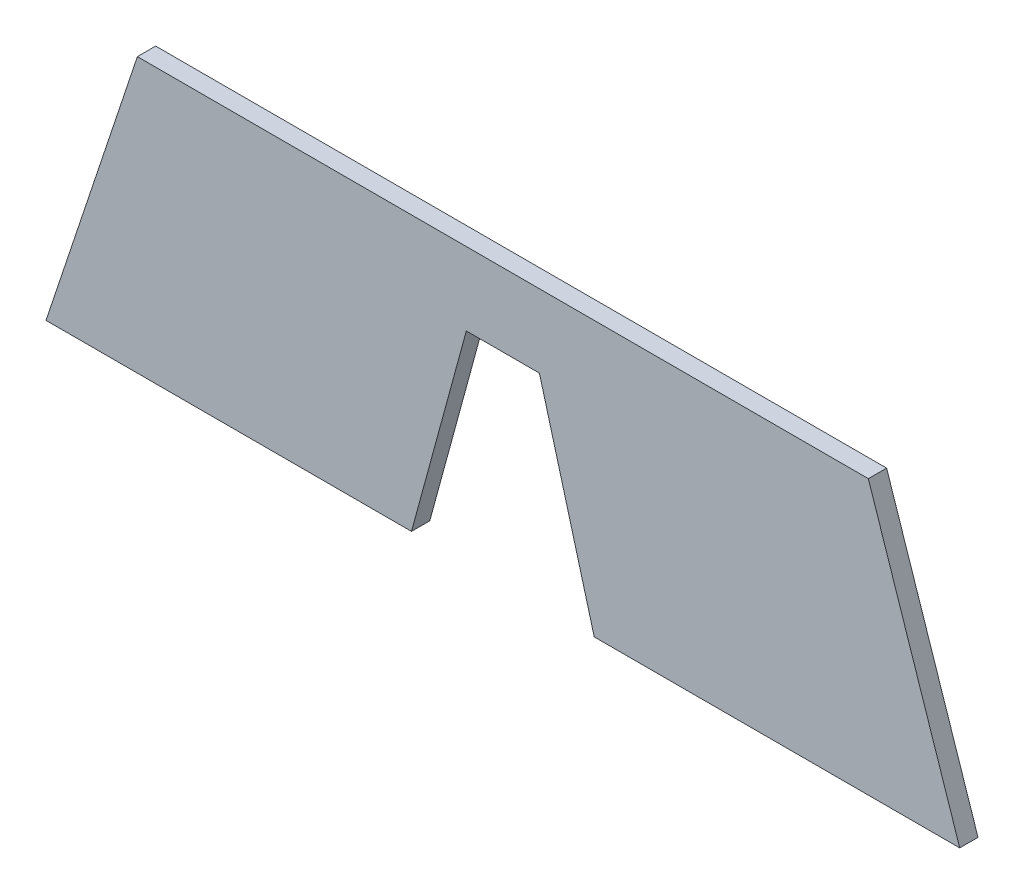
ISO-10303-21;
HEADER;
FILE_DESCRIPTION(('STEP AP214'),'2;1');
FILE_NAME('part.step','',(''),(''),'','','');
FILE_SCHEMA(('AUTOMOTIVE_DESIGN { 1 0 10303 214 1 1 1 1 }'));
ENDSEC;
DATA;
#1=APPLICATION_CONTEXT('core data for automotive mechanical design processes');
#2=APPLICATION_PROTOCOL_DEFINITION('international standard','automotive_design',2000,#1);
#3=PRODUCT_CONTEXT('',#1,'mechanical');
#4=PRODUCT('Part','Part','',(#3));
#5=PRODUCT_RELATED_PRODUCT_CATEGORY('part','',(#4));
#6=PRODUCT_DEFINITION_FORMATION('','',#4);
#7=PRODUCT_DEFINITION_CONTEXT('part definition',#1,'design');
#8=PRODUCT_DEFINITION('design','',#6,#7);
#9=PRODUCT_DEFINITION_SHAPE('','',#8);
#10=(LENGTH_UNIT() NAMED_UNIT(*) SI_UNIT(.MILLI.,.METRE.));
#11=(NAMED_UNIT(*) PLANE_ANGLE_UNIT() SI_UNIT($,.RADIAN.));
#12=(NAMED_UNIT(*) SI_UNIT($,.STERADIAN.) SOLID_ANGLE_UNIT());
#13=UNCERTAINTY_MEASURE_WITH_UNIT(LENGTH_MEASURE(1.E-05),#10,'distance_accuracy_value','');
#14=(GEOMETRIC_REPRESENTATION_CONTEXT(3) GLOBAL_UNCERTAINTY_ASSIGNED_CONTEXT((#13)) GLOBAL_UNIT_ASSIGNED_CONTEXT((#10,
#11,#12)) REPRESENTATION_CONTEXT('',''));
#15=CARTESIAN_POINT('',(0.,0.,0.));
#16=DIRECTION('',(0.,0.,1.));
#17=DIRECTION('',(1.,0.,0.));
#18=AXIS2_PLACEMENT_3D('',#15,#16,#17);
#19=CARTESIAN_POINT('',(0.,-8.00000000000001,2.));
#20=DIRECTION('',(0.,1.,0.));
#21=DIRECTION('',(-1.,0.,0.));
#22=AXIS2_PLACEMENT_3D('',#19,#20,#21);
#23=PLANE('',#22);
#24=DIRECTION('',(1.,0.,0.));
#25=VECTOR('',#24,1.);
#26=CARTESIAN_POINT('',(0.,-8.00000000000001,0.));
#27=LINE('',#26,#25);
#28=CARTESIAN_POINT('',(7.12802538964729,-8.,0.));
#29=VERTEX_POINT('',#28);
#30=CARTESIAN_POINT('',(15.1280253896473,-7.99999999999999,0.));
#31=VERTEX_POINT('',#30);
#32=EDGE_CURVE('E191',#29,#31,#27,.T.);
#33=ORIENTED_EDGE('',*,*,#32,.T.);
#34=DIRECTION('',(0.,0.,-1.));
#35=VECTOR('',#34,1.);
#36=CARTESIAN_POINT('',(15.1280253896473,-7.99999999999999,2.));
#37=LINE('',#36,#35);
#38=CARTESIAN_POINT('',(15.1280253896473,-7.99999999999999,2.));
#39=VERTEX_POINT('',#38);
#40=EDGE_CURVE('E11',#39,#31,#37,.T.);
#41=ORIENTED_EDGE('',*,*,#40,.F.);
#42=DIRECTION('',(1.,0.,0.));
#43=VECTOR('',#42,1.);
#44=CARTESIAN_POINT('',(0.,-8.00000000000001,2.));
#45=LINE('',#44,#43);
#46=CARTESIAN_POINT('',(7.12802538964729,-8.,2.));
#47=VERTEX_POINT('',#46);
#48=EDGE_CURVE('E148',#47,#39,#45,.T.);
#49=ORIENTED_EDGE('',*,*,#48,.F.);
#50=DIRECTION('',(0.,0.,-1.));
#51=VECTOR('',#50,1.);
#52=CARTESIAN_POINT('',(7.12802538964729,-8.,2.));
#53=LINE('',#52,#51);
#54=EDGE_CURVE('E138',#47,#29,#53,.T.);
#55=ORIENTED_EDGE('',*,*,#54,.T.);
#56=EDGE_LOOP('',(#33,#41,#49,#55));
#57=FACE_BOUND('',#56,.T.);
#58=ADVANCED_FACE('F41',(#57),#23,.F.);
#59=CARTESIAN_POINT('',(12.0499313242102,3.28634490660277,2.));
#60=DIRECTION('',(0.964763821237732,0.263117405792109,0.));
#61=DIRECTION('',(-0.263117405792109,0.964763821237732,0.));
#62=AXIS2_PLACEMENT_3D('',#59,#60,#61);
#63=PLANE('',#62);
#64=DIRECTION('',(0.263117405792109,-0.964763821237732,0.));
#65=VECTOR('',#64,1.);
#66=CARTESIAN_POINT('',(12.0499313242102,3.28634490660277,0.));
#67=LINE('',#66,#65);
#68=CARTESIAN_POINT('',(21.1280253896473,-30.,0.));
#69=VERTEX_POINT('',#68);
#70=EDGE_CURVE('E182',#31,#69,#67,.T.);
#71=ORIENTED_EDGE('',*,*,#70,.T.);
#72=DIRECTION('',(0.,0.,-1.));
#73=VECTOR('',#72,1.);
#74=CARTESIAN_POINT('',(21.1280253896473,-30.,2.));
#75=LINE('',#74,#73);
#76=CARTESIAN_POINT('',(21.1280253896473,-30.,2.));
#77=VERTEX_POINT('',#76);
#78=EDGE_CURVE('E50',#77,#69,#75,.T.);
#79=ORIENTED_EDGE('',*,*,#78,.F.);
#80=DIRECTION('',(0.263117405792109,-0.964763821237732,0.));
#81=VECTOR('',#80,1.);
#82=CARTESIAN_POINT('',(12.0499313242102,3.28634490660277,2.));
#83=LINE('',#82,#81);
#84=EDGE_CURVE('E101',#39,#77,#83,.T.);
#85=ORIENTED_EDGE('',*,*,#84,.F.);
#86=ORIENTED_EDGE('',*,*,#40,.T.);
#87=EDGE_LOOP('',(#71,#79,#85,#86));
#88=FACE_BOUND('',#87,.T.);
#89=ADVANCED_FACE('F210',(#88),#63,.F.);
#90=CARTESIAN_POINT('',(0.,-30.,2.));
#91=DIRECTION('',(0.,1.,0.));
#92=DIRECTION('',(0.,0.,1.));
#93=AXIS2_PLACEMENT_3D('',#90,#91,#92);
#94=PLANE('',#93);
#95=DIRECTION('',(1.,0.,0.));
#96=VECTOR('',#95,1.);
#97=CARTESIAN_POINT('',(0.,-30.,0.));
#98=LINE('',#97,#96);
#99=CARTESIAN_POINT('',(61.1280253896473,-30.,0.));
#100=VERTEX_POINT('',#99);
#101=EDGE_CURVE('E157',#69,#100,#98,.T.);
#102=ORIENTED_EDGE('',*,*,#101,.T.);
#103=DIRECTION('',(0.,0.,-1.));
#104=VECTOR('',#103,1.);
#105=CARTESIAN_POINT('',(61.1280253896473,-30.,2.));
#106=LINE('',#105,#104);
#107=CARTESIAN_POINT('',(61.1280253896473,-30.,2.));
#108=VERTEX_POINT('',#107);
#109=EDGE_CURVE('E170',#108,#100,#106,.T.);
#110=ORIENTED_EDGE('',*,*,#109,.F.);
#111=DIRECTION('',(1.,0.,0.));
#112=VECTOR('',#111,1.);
#113=CARTESIAN_POINT('',(0.,-30.,2.));
#114=LINE('',#113,#112);
#115=EDGE_CURVE('E136',#77,#108,#114,.T.);
#116=ORIENTED_EDGE('',*,*,#115,.F.);
#117=ORIENTED_EDGE('',*,*,#78,.T.);
#118=EDGE_LOOP('',(#102,#110,#116,#117));
#119=FACE_BOUND('',#118,.T.);
#120=ADVANCED_FACE('F177',(#119),#94,.F.);
#121=CARTESIAN_POINT('',(46.0152228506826,15.3384076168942,2.));
#122=DIRECTION('',(-0.948683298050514,-0.316227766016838,0.));
#123=DIRECTION('',(0.316227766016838,-0.948683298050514,0.));
#124=AXIS2_PLACEMENT_3D('',#121,#122,#123);
#125=PLANE('',#124);
#126=DIRECTION('',(-0.316227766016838,0.948683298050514,0.));
#127=VECTOR('',#126,1.);
#128=CARTESIAN_POINT('',(46.0152228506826,15.3384076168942,0.));
#129=LINE('',#128,#127);
#130=CARTESIAN_POINT('',(51.1280253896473,0.,0.));
#131=VERTEX_POINT('',#130);
#132=EDGE_CURVE('E185',#100,#131,#129,.T.);
#133=ORIENTED_EDGE('',*,*,#132,.T.);
#134=DIRECTION('',(0.,0.,-1.));
#135=VECTOR('',#134,1.);
#136=CARTESIAN_POINT('',(51.1280253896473,0.,2.));
#137=LINE('',#136,#135);
#138=CARTESIAN_POINT('',(51.1280253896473,0.,2.));
#139=VERTEX_POINT('',#138);
#140=EDGE_CURVE('E167',#139,#131,#137,.T.);
#141=ORIENTED_EDGE('',*,*,#140,.F.);
#142=DIRECTION('',(-0.316227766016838,0.948683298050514,0.));
#143=VECTOR('',#142,1.);
#144=CARTESIAN_POINT('',(46.0152228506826,15.3384076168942,2.));
#145=LINE('',#144,#143);
#146=EDGE_CURVE('E143',#108,#139,#145,.T.);
#147=ORIENTED_EDGE('',*,*,#146,.F.);
#148=ORIENTED_EDGE('',*,*,#109,.T.);
#149=EDGE_LOOP('',(#133,#141,#147,#148));
#150=FACE_BOUND('',#149,.T.);
#151=ADVANCED_FACE('F202',(#150),#125,.F.);
#152=CARTESIAN_POINT('',(0.,0.,2.));
#153=DIRECTION('',(0.,1.,0.));
#154=DIRECTION('',(0.,0.,1.));
#155=AXIS2_PLACEMENT_3D('',#152,#153,#154);
#156=PLANE('',#155);
#157=DIRECTION('',(1.,0.,0.));
#158=VECTOR('',#157,1.);
#159=CARTESIAN_POINT('',(0.,0.,0.));
#160=LINE('',#159,#158);
#161=CARTESIAN_POINT('',(-28.8719746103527,0.,0.));
#162=VERTEX_POINT('',#161);
#163=EDGE_CURVE('E189',#162,#131,#160,.T.);
#164=ORIENTED_EDGE('',*,*,#163,.F.);
#165=DIRECTION('',(0.,0.,-1.));
#166=VECTOR('',#165,1.);
#167=CARTESIAN_POINT('',(-28.8719746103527,0.,2.));
#168=LINE('',#167,#166);
#169=CARTESIAN_POINT('',(-28.8719746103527,0.,2.));
#170=VERTEX_POINT('',#169);
#171=EDGE_CURVE('E130',#170,#162,#168,.T.);
#172=ORIENTED_EDGE('',*,*,#171,.F.);
#173=DIRECTION('',(1.,0.,0.));
#174=VECTOR('',#173,1.);
#175=CARTESIAN_POINT('',(0.,0.,2.));
#176=LINE('',#175,#174);
#177=EDGE_CURVE('E121',#170,#139,#176,.T.);
#178=ORIENTED_EDGE('',*,*,#177,.T.);
#179=ORIENTED_EDGE('',*,*,#140,.T.);
#180=EDGE_LOOP('',(#164,#172,#178,#179));
#181=FACE_BOUND('',#180,.T.);
#182=ADVANCED_FACE('F198',(#181),#156,.T.);
#183=CARTESIAN_POINT('',(-25.9847771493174,8.66159238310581,2.));
#184=DIRECTION('',(0.948683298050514,-0.316227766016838,0.));
#185=DIRECTION('',(0.316227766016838,0.948683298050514,0.));
#186=AXIS2_PLACEMENT_3D('',#183,#184,#185);
#187=PLANE('',#186);
#188=DIRECTION('',(-0.316227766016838,-0.948683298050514,0.));
#189=VECTOR('',#188,1.);
#190=CARTESIAN_POINT('',(-25.9847771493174,8.66159238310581,0.));
#191=LINE('',#190,#189);
#192=CARTESIAN_POINT('',(-38.8719746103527,-30.,0.));
#193=VERTEX_POINT('',#192);
#194=EDGE_CURVE('E128',#162,#193,#191,.T.);
#195=ORIENTED_EDGE('',*,*,#194,.T.);
#196=DIRECTION('',(0.,0.,-1.));
#197=VECTOR('',#196,1.);
#198=CARTESIAN_POINT('',(-38.8719746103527,-30.,2.));
#199=LINE('',#198,#197);
#200=CARTESIAN_POINT('',(-38.8719746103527,-30.,2.));
#201=VERTEX_POINT('',#200);
#202=EDGE_CURVE('E125',#201,#193,#199,.T.);
#203=ORIENTED_EDGE('',*,*,#202,.F.);
#204=DIRECTION('',(-0.316227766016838,-0.948683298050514,0.));
#205=VECTOR('',#204,1.);
#206=CARTESIAN_POINT('',(-25.9847771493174,8.66159238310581,2.));
#207=LINE('',#206,#205);
#208=EDGE_CURVE('E115',#170,#201,#207,.T.);
#209=ORIENTED_EDGE('',*,*,#208,.F.);
#210=ORIENTED_EDGE('',*,*,#171,.T.);
#211=EDGE_LOOP('',(#195,#203,#209,#210));
#212=FACE_BOUND('',#211,.T.);
#213=ADVANCED_FACE('F126',(#212),#187,.F.);
#214=CARTESIAN_POINT('',(1.1280253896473,-30.,0.));
#215=VERTEX_POINT('',#214);
#216=EDGE_CURVE('E87',#193,#215,#98,.T.);
#217=ORIENTED_EDGE('',*,*,#216,.T.);
#218=DIRECTION('',(0.,0.,-1.));
#219=VECTOR('',#218,1.);
#220=CARTESIAN_POINT('',(1.1280253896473,-30.,2.));
#221=LINE('',#220,#219);
#222=CARTESIAN_POINT('',(1.1280253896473,-30.,2.));
#223=VERTEX_POINT('',#222);
#224=EDGE_CURVE('E131',#223,#215,#221,.T.);
#225=ORIENTED_EDGE('',*,*,#224,.F.);
#226=EDGE_CURVE('E119',#201,#223,#114,.T.);
#227=ORIENTED_EDGE('',*,*,#226,.F.);
#228=ORIENTED_EDGE('',*,*,#202,.T.);
#229=EDGE_LOOP('',(#217,#225,#227,#228));
#230=FACE_BOUND('',#229,.T.);
#231=ADVANCED_FACE('F133',(#230),#94,.F.);
#232=CARTESIAN_POINT('',(8.66531593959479,-2.36326798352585,2.));
#233=DIRECTION('',(-0.964763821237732,0.263117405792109,0.));
#234=DIRECTION('',(-0.263117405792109,-0.964763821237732,0.));
#235=AXIS2_PLACEMENT_3D('',#232,#233,#234);
#236=PLANE('',#235);
#237=DIRECTION('',(0.263117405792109,0.964763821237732,0.));
#238=VECTOR('',#237,1.);
#239=CARTESIAN_POINT('',(8.66531593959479,-2.36326798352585,0.));
#240=LINE('',#239,#238);
#241=EDGE_CURVE('E93',#215,#29,#240,.T.);
#242=ORIENTED_EDGE('',*,*,#241,.T.);
#243=ORIENTED_EDGE('',*,*,#54,.F.);
#244=DIRECTION('',(0.263117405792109,0.964763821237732,0.));
#245=VECTOR('',#244,1.);
#246=CARTESIAN_POINT('',(8.66531593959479,-2.36326798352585,2.));
#247=LINE('',#246,#245);
#248=EDGE_CURVE('E58',#223,#47,#247,.T.);
#249=ORIENTED_EDGE('',*,*,#248,.F.);
#250=ORIENTED_EDGE('',*,*,#224,.T.);
#251=EDGE_LOOP('',(#242,#243,#249,#250));
#252=FACE_BOUND('',#251,.T.);
#253=ADVANCED_FACE('F221',(#252),#236,.F.);
#254=CARTESIAN_POINT('',(0.,0.,2.));
#255=DIRECTION('',(0.,0.,1.));
#256=DIRECTION('',(1.,0.,0.));
#257=AXIS2_PLACEMENT_3D('',#254,#255,#256);
#258=PLANE('',#257);
#259=ORIENTED_EDGE('',*,*,#48,.T.);
#260=ORIENTED_EDGE('',*,*,#84,.T.);
#261=ORIENTED_EDGE('',*,*,#115,.T.);
#262=ORIENTED_EDGE('',*,*,#146,.T.);
#263=ORIENTED_EDGE('',*,*,#177,.F.);
#264=ORIENTED_EDGE('',*,*,#208,.T.);
#265=ORIENTED_EDGE('',*,*,#226,.T.);
#266=ORIENTED_EDGE('',*,*,#248,.T.);
#267=EDGE_LOOP('',(#259,#260,#261,#262,#263,#264,#265,#266));
#268=FACE_BOUND('',#267,.T.);
#269=ADVANCED_FACE('F117',(#268),#258,.T.);
#270=CARTESIAN_POINT('',(0.,0.,0.));
#271=DIRECTION('',(0.,0.,1.));
#272=DIRECTION('',(1.,0.,0.));
#273=AXIS2_PLACEMENT_3D('',#270,#271,#272);
#274=PLANE('',#273);
#275=ORIENTED_EDGE('',*,*,#32,.F.);
#276=ORIENTED_EDGE('',*,*,#241,.F.);
#277=ORIENTED_EDGE('',*,*,#216,.F.);
#278=ORIENTED_EDGE('',*,*,#194,.F.);
#279=ORIENTED_EDGE('',*,*,#163,.T.);
#280=ORIENTED_EDGE('',*,*,#132,.F.);
#281=ORIENTED_EDGE('',*,*,#101,.F.);
#282=ORIENTED_EDGE('',*,*,#70,.F.);
#283=EDGE_LOOP('',(#275,#276,#277,#278,#279,#280,#281,#282));
#284=FACE_BOUND('',#283,.T.);
#285=ADVANCED_FACE('F181',(#284),#274,.F.);
#286=CLOSED_SHELL('',(#58,#89,#120,#151,#182,#213,#231,#253,#269,#285));
#287=MANIFOLD_SOLID_BREP('B2',#286);
#288=ADVANCED_BREP_SHAPE_REPRESENTATION('',(#18,#287),#14);
#289=SHAPE_DEFINITION_REPRESENTATION(#9,#288);
ENDSEC;
END-ISO-10303-21;
